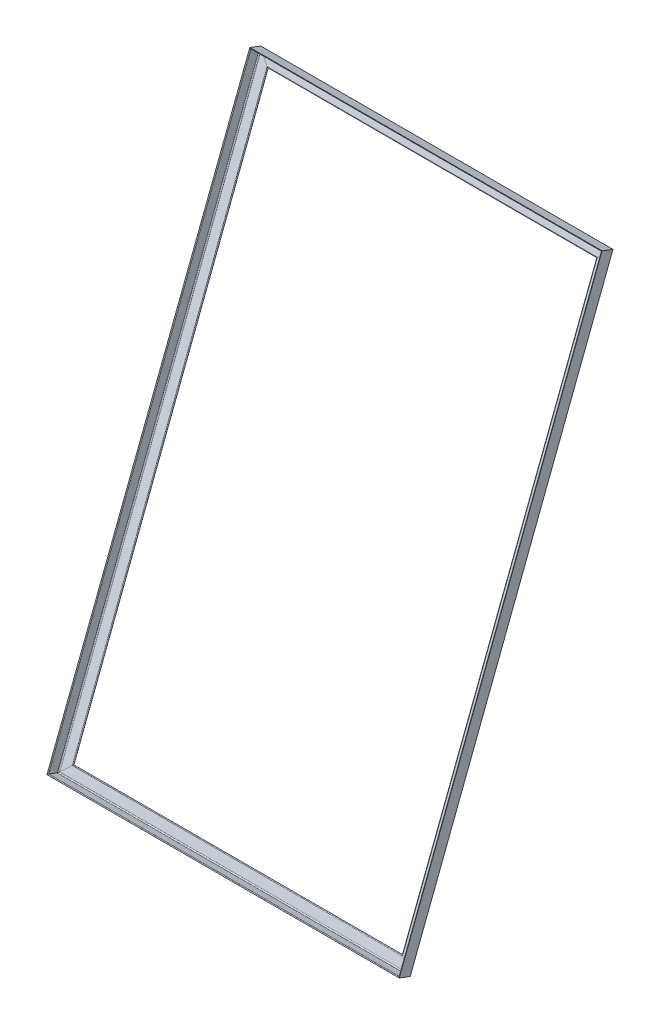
from build123d import *

# Parameters (mm, degrees)
ANGLE_IRON_2_X_2_X_0_125_1_DEPTH      = 2521.481660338
ANGLE_IRON_2_X_2_X_0_125_1_DEPTH_BACK = 72.842048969
ANGLE_IRON_2_X_2_X_0_125_1_2_DEPTH    = 1669.684097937
ANGLE_IRON_2_X_2_X_0_125_1_3_DEPTH    = 2594.323709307
ANGLE_IRON_2_X_2_X_0_125_1_4_DEPTH    = 1669.684097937


with BuildPart() as part:
    # Sketch11 → Angle iron 2 X 2 X 0.125_1 (new, two sides: drawn at the far end of the back side and taken through both)
    with BuildSketch(Plane(origin=(0, 4572, 0), x_dir=(1, 0, 0), z_dir=(0, -0.9335796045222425, 0.35837009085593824)).offset(-ANGLE_IRON_2_X_2_X_0_125_1_DEPTH_BACK)):
        with BuildLine():
            Line((0, 0), (0, 50.8))
            Line((0, 50.8), (0.00508, 50.8))
            ThreePointArc((0.00508, 50.8), (2.246551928, 49.871551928), (3.175, 47.63008))
            Line((3.175, 47.63008), (3.175, 7.9375))
            ThreePointArc((3.175, 7.9375), (4.569903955, 4.569903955), (7.9375, 3.175))
            Line((7.9375, 3.175), (47.63008, 3.175))
            ThreePointArc((47.63008, 3.175), (49.871551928, 2.246551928), (50.8, 0.00508))
            Line((50.8, 0.00508), (50.8, 0))
            Line((50.8, 0), (0, 0))
        make_face()
    extrude(amount=ANGLE_IRON_2_X_2_X_0_125_1_DEPTH + ANGLE_IRON_2_X_2_X_0_125_1_DEPTH_BACK)

    # Angle iron 2 X 2 X 0.125_1 mitre 1
    split(bisect_by=Plane(origin=(0, 4572, 0), x_dir=(0.682414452, -0.730965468, 0), z_dir=(-0.707106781, -0.660140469, 0.253405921)), keep=Keep.TOP)

    # Angle iron 2 X 2 X 0.125_1 mitre 2
    split(bisect_by=Plane(origin=(0, 2286, 877.5192), x_dir=(-0.682414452, -0.730965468, 0), z_dir=(-0.707106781, 0.660140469, -0.253405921)), keep=Keep.TOP)


with BuildPart() as body_2:
    # Sketch11 on segment 2 (on carried to segment 2) → Angle iron 2 X 2 X 0.125_1 2 (new body)
    with BuildSketch(Plane(origin=(-72.842048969, 2286, 877.5192), x_dir=(0, 0.933579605, -0.358370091), z_dir=(1, 0, 0))):
        with BuildLine():
            Line((0, 0), (0, 50.8))
            Line((0, 50.8), (0.00508, 50.8))
            ThreePointArc((0.00508, 50.8), (2.246551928, 49.871551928), (3.175, 47.63008))
            Line((3.175, 47.63008), (3.175, 7.9375))
            ThreePointArc((3.175, 7.9375), (4.569903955, 4.569903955), (7.9375, 3.175))
            Line((7.9375, 3.175), (47.63008, 3.175))
            ThreePointArc((47.63008, 3.175), (49.871551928, 2.246551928), (50.8, 0.00508))
            Line((50.8, 0.00508), (50.8, 0))
            Line((50.8, 0), (0, 0))
        make_face()
    extrude(amount=ANGLE_IRON_2_X_2_X_0_125_1_2_DEPTH)

    # Angle iron 2 X 2 X 0.125_1 2 mitre 1
    split(bisect_by=Plane(origin=(0, 2286, 877.5192), x_dir=(0.682414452, 0.730965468, 0), z_dir=(0.707106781, -0.660140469, 0.253405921)), keep=Keep.TOP)

    # Angle iron 2 X 2 X 0.125_1 2 mitre 2
    split(bisect_by=Plane(origin=(1524, 2286, 877.5192), x_dir=(0.682414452, -0.730965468, 0), z_dir=(-0.707106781, -0.660140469, 0.253405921)), keep=Keep.TOP)


with BuildPart() as body_3:
    # Sketch11 on segment 3 (on carried to segment 3) → Angle iron 2 X 2 X 0.125_1 3 (new body)
    with BuildSketch(Plane(origin=(1524, 2217.996148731, 903.623611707), x_dir=(-1, 0, 0), z_dir=(0, 0.933579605, -0.358370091))):
        with BuildLine():
            Line((0, 0), (0, 50.8))
            Line((0, 50.8), (0.00508, 50.8))
            ThreePointArc((0.00508, 50.8), (2.246551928, 49.871551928), (3.175, 47.63008))
            Line((3.175, 47.63008), (3.175, 7.9375))
            ThreePointArc((3.175, 7.9375), (4.569903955, 4.569903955), (7.9375, 3.175))
            Line((7.9375, 3.175), (47.63008, 3.175))
            ThreePointArc((47.63008, 3.175), (49.871551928, 2.246551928), (50.8, 0.00508))
            Line((50.8, 0.00508), (50.8, 0))
            Line((50.8, 0), (0, 0))
        make_face()
    extrude(amount=ANGLE_IRON_2_X_2_X_0_125_1_3_DEPTH)

    # Angle iron 2 X 2 X 0.125_1 3 mitre 1
    split(bisect_by=Plane(origin=(1524, 4572, 0), x_dir=(0.682414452, 0.730965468, 0), z_dir=(0.707106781, -0.660140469, 0.253405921)), keep=Keep.TOP)

    # Angle iron 2 X 2 X 0.125_1 3 mitre 2
    split(bisect_by=Plane(origin=(1524, 2286, 877.5192), x_dir=(-0.682414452, 0.730965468, 0), z_dir=(0.707106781, 0.660140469, -0.253405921)), keep=Keep.TOP)


with BuildPart() as body_4:
    # Sketch11 on segment 4 (on carried to segment 4) → Angle iron 2 X 2 X 0.125_1 4 (new body)
    with BuildSketch(Plane(origin=(1596.842048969, 4572, 0), x_dir=(0, -0.933579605, 0.358370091), z_dir=(-1, 0, 0))):
        with BuildLine():
            Line((0, 0), (0, 50.8))
            Line((0, 50.8), (0.00508, 50.8))
            ThreePointArc((0.00508, 50.8), (2.246551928, 49.871551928), (3.175, 47.63008))
            Line((3.175, 47.63008), (3.175, 7.9375))
            ThreePointArc((3.175, 7.9375), (4.569903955, 4.569903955), (7.9375, 3.175))
            Line((7.9375, 3.175), (47.63008, 3.175))
            ThreePointArc((47.63008, 3.175), (49.871551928, 2.246551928), (50.8, 0.00508))
            Line((50.8, 0.00508), (50.8, 0))
            Line((50.8, 0), (0, 0))
        make_face()
    extrude(amount=ANGLE_IRON_2_X_2_X_0_125_1_4_DEPTH)

    # Angle iron 2 X 2 X 0.125_1 4 mitre 1
    split(bisect_by=Plane(origin=(0, 4572, 0), x_dir=(-0.682414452, 0.730965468, 0), z_dir=(0.707106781, 0.660140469, -0.253405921)), keep=Keep.TOP)

    # Angle iron 2 X 2 X 0.125_1 4 mitre 2
    split(bisect_by=Plane(origin=(1524, 4572, 0), x_dir=(-0.682414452, -0.730965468, 0), z_dir=(-0.707106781, 0.660140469, -0.253405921)), keep=Keep.TOP)


solid = Compound([part.part, body_2.part, body_3.part, body_4.part])
